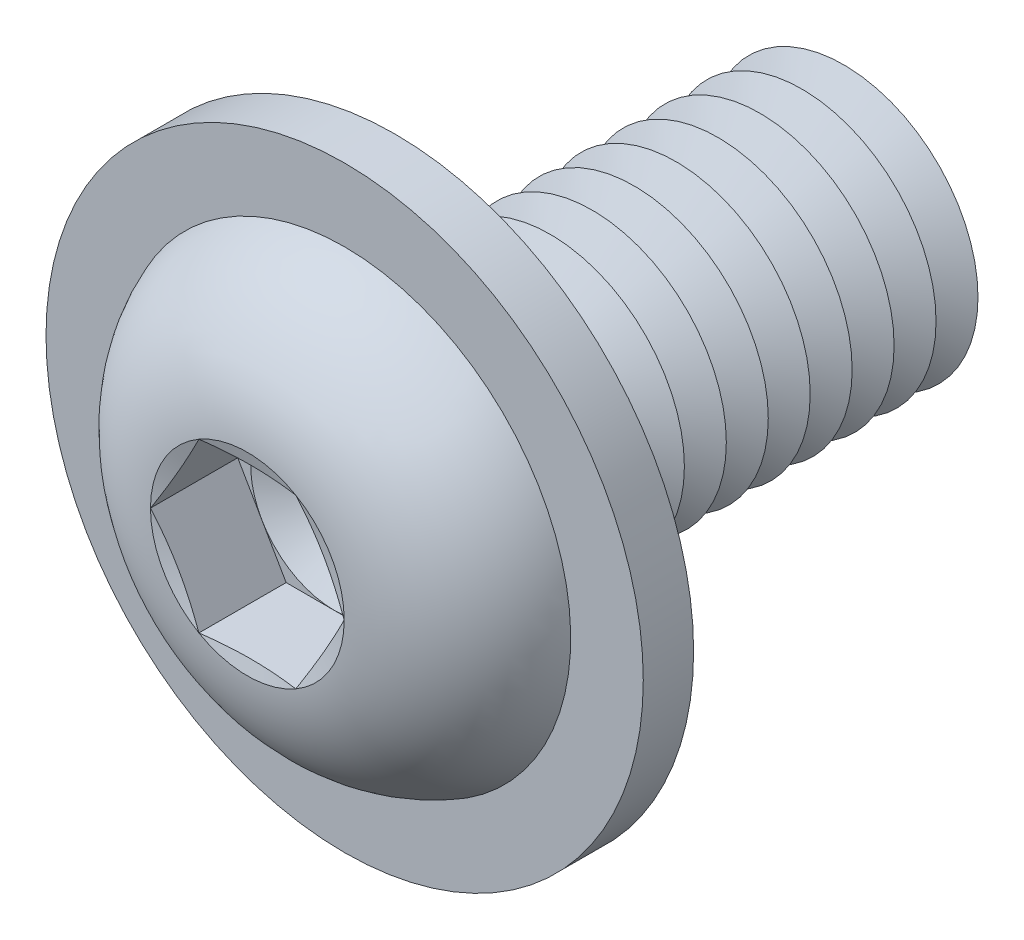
from build123d import *

# Parameters (mm, degrees)
FILLET1_R           = 0.625
LPATTERN1_COUNT     = 11
LPATTERN1_PITCH     = 1.25
CUT_EXTRUDE1_DEPTH  = 2.6
SKETCH5_R           = 8.9
SKETCH5_R_2         = 4.625
BOSS_EXTRUDE1_DEPTH = 1.5


with BuildPart() as part:
    # Sketch1 → Revolve1 (revolve)
    with BuildSketch(Plane(origin=(0, 0, 0), x_dir=(0, 0, -1), z_dir=(1, 0, 0)), mode=Mode.PRIVATE) as revolve1_sk:
        with BuildLine():
            Line((0, 4), (0, 7))
            ThreePointArc((0, 7), (-3.011595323, 5.81154966), (-4.4, 2.88675))
            Line((-4.4, 2.88675), (-4.013248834, 1.443375))
            Line((-4.013248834, 1.443375), (-4.4, 1.443375))
            Line((-4.4, 1.443375), (-4.4, 0))
            Line((-4.4, 0), (14, 0))
            Line((14, 0), (14, 4))
            Line((14, 4), (0, 4))
        make_face()
    revolve(revolve1_sk.sketch.rotate(Axis((0, 0, -14), (0, 0, 1)), 90), axis=Axis((0, 0, -14), (0, 0, 1)))

    # Fillet1
    fillet1_edges = [part.edges().sort_by_distance(p)[0] for p in [
        (4, 0, 0),
    ]]
    fillet(fillet1_edges, radius=FILLET1_R)

    # Sketch2 → Cut-Revolve1 (revolve, cut)
    with BuildSketch(Plane(origin=(0, 0, 0), x_dir=(0, 0, -1), z_dir=(1, 0, 0)), mode=Mode.PRIVATE) as cut_revolve1_sk:
        Polygon((13.375, 4), (14.625, 4), (14, 2.917468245), align=None)
    cut_revolve1 = revolve(cut_revolve1_sk.sketch.rotate(Axis((0, 0, -14), (0, 0, -1)), 270), axis=Axis((0, 0, -14), (0, 0, -1)), mode=Mode.SUBTRACT)

    # LPattern1: Cut-Revolve1 ×11
    with Locations(*[(0, 0, i * LPATTERN1_PITCH) for i in range(1, LPATTERN1_COUNT)]):
        add(cut_revolve1, mode=Mode.SUBTRACT)

    # Sketch3 → Cut-Extrude1 (cut)
    with BuildSketch(Plane.XY.offset(4.4)):
        Polygon((1.443375, 2.499998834), (-1.443375, 2.499998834), (-2.88675, 0), (-1.443375, -2.499998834), (1.443375, -2.499998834), (2.88675, 0), align=None)
    extrude(amount=-CUT_EXTRUDE1_DEPTH, mode=Mode.SUBTRACT)

    # Cut-Extrude2 cone 1 section (on through the dimple's axis) → Cut-Extrude2 (revolve, cut)
    with BuildSketch(Plane(origin=(0, 0, 1.8), x_dir=(0, -1, 0), z_dir=(1, 0, 0))):
        Polygon((0, 0), (2.499998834, 0), (0, 1.443375), align=None)
    revolve(axis=Axis((0, 0, 1.8), (0, 0, -1)), mode=Mode.SUBTRACT)

    # Sketch5 → Boss-Extrude1 (add)
    with BuildSketch(Plane(origin=(0, 0, 0), x_dir=(-1, 0, 0), z_dir=(0, 0, -1))):
        with Locations(Location((0, 0, 0), (0, 0, 90))):
            Circle(SKETCH5_R)
        Circle(SKETCH5_R_2, mode=Mode.SUBTRACT)
    extrude(amount=-BOSS_EXTRUDE1_DEPTH)


solid = part.part
